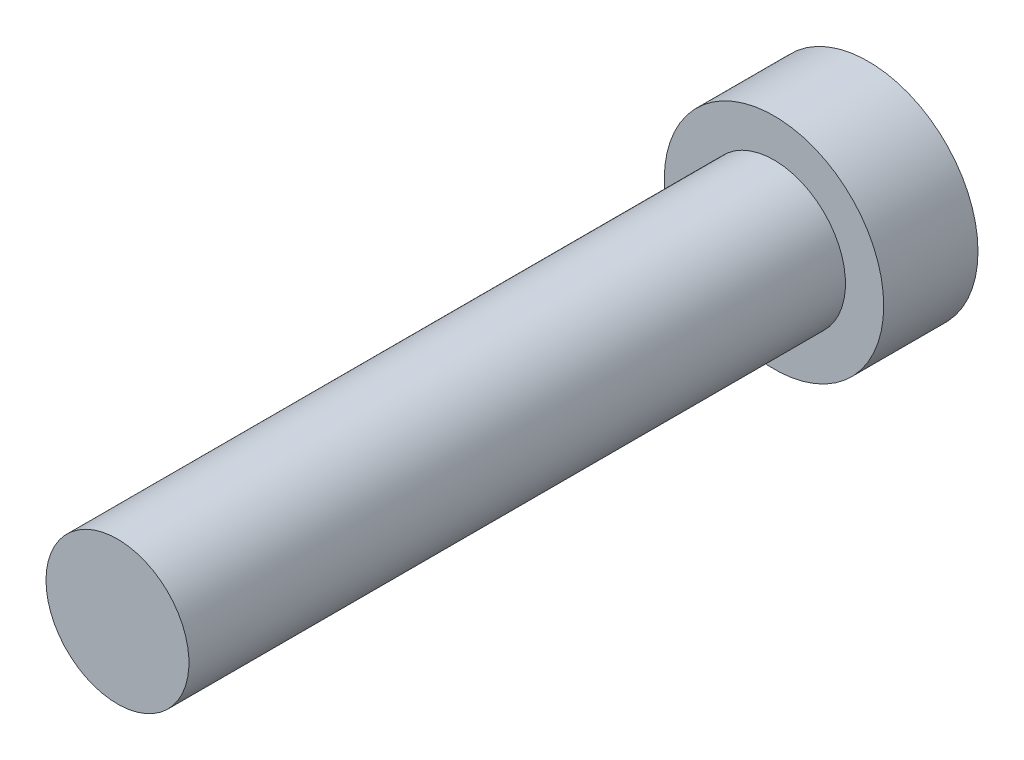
ISO-10303-21;
HEADER;
FILE_DESCRIPTION(('STEP AP214'),'2;1');
FILE_NAME('part.step','',(''),(''),'','','');
FILE_SCHEMA(('AUTOMOTIVE_DESIGN { 1 0 10303 214 1 1 1 1 }'));
ENDSEC;
DATA;
#1=APPLICATION_CONTEXT('core data for automotive mechanical design processes');
#2=APPLICATION_PROTOCOL_DEFINITION('international standard','automotive_design',2000,#1);
#3=PRODUCT_CONTEXT('',#1,'mechanical');
#4=PRODUCT('Part','Part','',(#3));
#5=PRODUCT_RELATED_PRODUCT_CATEGORY('part','',(#4));
#6=PRODUCT_DEFINITION_FORMATION('','',#4);
#7=PRODUCT_DEFINITION_CONTEXT('part definition',#1,'design');
#8=PRODUCT_DEFINITION('design','',#6,#7);
#9=PRODUCT_DEFINITION_SHAPE('','',#8);
#10=(LENGTH_UNIT() NAMED_UNIT(*) SI_UNIT(.MILLI.,.METRE.));
#11=(NAMED_UNIT(*) PLANE_ANGLE_UNIT() SI_UNIT($,.RADIAN.));
#12=(NAMED_UNIT(*) SI_UNIT($,.STERADIAN.) SOLID_ANGLE_UNIT());
#13=UNCERTAINTY_MEASURE_WITH_UNIT(LENGTH_MEASURE(1.E-05),#10,'distance_accuracy_value','');
#14=(GEOMETRIC_REPRESENTATION_CONTEXT(3) GLOBAL_UNCERTAINTY_ASSIGNED_CONTEXT((#13)) GLOBAL_UNIT_ASSIGNED_CONTEXT((#10,
#11,#12)) REPRESENTATION_CONTEXT('',''));
#15=CARTESIAN_POINT('',(0.,0.,0.));
#16=DIRECTION('',(0.,0.,1.));
#17=DIRECTION('',(1.,0.,0.));
#18=AXIS2_PLACEMENT_3D('',#15,#16,#17);
#19=CARTESIAN_POINT('',(0.,0.,-16.5467541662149));
#20=DIRECTION('',(0.,0.,-1.));
#21=DIRECTION('',(-1.,0.,0.));
#22=AXIS2_PLACEMENT_3D('',#19,#20,#21);
#23=CYLINDRICAL_SURFACE('',#22,5.55625);
#24=CARTESIAN_POINT('',(0.,0.,-4.7752));
#25=DIRECTION('',(0.,0.,-1.));
#26=DIRECTION('',(-1.,0.,0.));
#27=AXIS2_PLACEMENT_3D('',#24,#25,#26);
#28=CIRCLE('',#27,5.55625);
#29=CARTESIAN_POINT('',(-5.55625,0.,-4.7752));
#30=VERTEX_POINT('',#29);
#31=EDGE_CURVE('E58',#30,#30,#28,.T.);
#32=ORIENTED_EDGE('',*,*,#31,.F.);
#33=EDGE_LOOP('',(#32));
#34=FACE_BOUND('',#33,.T.);
#35=CARTESIAN_POINT('',(0.,0.,0.));
#36=DIRECTION('',(0.,0.,-1.));
#37=DIRECTION('',(-1.,0.,0.));
#38=AXIS2_PLACEMENT_3D('',#35,#36,#37);
#39=CIRCLE('',#38,5.55625);
#40=CARTESIAN_POINT('',(-5.55625,0.,0.));
#41=VERTEX_POINT('',#40);
#42=EDGE_CURVE('E10',#41,#41,#39,.T.);
#43=ORIENTED_EDGE('',*,*,#42,.T.);
#44=EDGE_LOOP('',(#43));
#45=FACE_BOUND('',#44,.T.);
#46=ADVANCED_FACE('F39',(#34,#45),#23,.T.);
#47=CARTESIAN_POINT('',(-3.6195,0.,0.));
#48=DIRECTION('',(0.,0.,-1.));
#49=DIRECTION('',(-1.,0.,0.));
#50=AXIS2_PLACEMENT_3D('',#47,#48,#49);
#51=PLANE('',#50);
#52=ORIENTED_EDGE('',*,*,#42,.F.);
#53=EDGE_LOOP('',(#52));
#54=FACE_BOUND('',#53,.T.);
#55=CARTESIAN_POINT('',(0.,0.,0.));
#56=DIRECTION('',(0.,0.,-1.));
#57=DIRECTION('',(-1.,0.,0.));
#58=AXIS2_PLACEMENT_3D('',#55,#56,#57);
#59=CIRCLE('',#58,3.6195);
#60=CARTESIAN_POINT('',(-3.6195,0.,0.));
#61=VERTEX_POINT('',#60);
#62=EDGE_CURVE('E46',#61,#61,#59,.T.);
#63=ORIENTED_EDGE('',*,*,#62,.T.);
#64=EDGE_LOOP('',(#63));
#65=FACE_BOUND('',#64,.T.);
#66=ADVANCED_FACE('F69',(#54,#65),#51,.F.);
#67=CARTESIAN_POINT('',(0.,0.,-16.5467541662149));
#68=DIRECTION('',(0.,0.,-1.));
#69=DIRECTION('',(-1.,0.,0.));
#70=AXIS2_PLACEMENT_3D('',#67,#68,#69);
#71=CYLINDRICAL_SURFACE('',#70,3.6195);
#72=ORIENTED_EDGE('',*,*,#62,.F.);
#73=EDGE_LOOP('',(#72));
#74=FACE_BOUND('',#73,.T.);
#75=CARTESIAN_POINT('',(0.,0.,33.24987));
#76=DIRECTION('',(0.,0.,-1.));
#77=DIRECTION('',(-1.,0.,0.));
#78=AXIS2_PLACEMENT_3D('',#75,#76,#77);
#79=CIRCLE('',#78,3.6195);
#80=CARTESIAN_POINT('',(-3.6195,0.,33.24987));
#81=VERTEX_POINT('',#80);
#82=EDGE_CURVE('E52',#81,#81,#79,.T.);
#83=ORIENTED_EDGE('',*,*,#82,.T.);
#84=EDGE_LOOP('',(#83));
#85=FACE_BOUND('',#84,.T.);
#86=ADVANCED_FACE('F73',(#74,#85),#71,.T.);
#87=CARTESIAN_POINT('',(0.,0.,33.24987));
#88=DIRECTION('',(0.,0.,-1.));
#89=DIRECTION('',(-1.,0.,0.));
#90=AXIS2_PLACEMENT_3D('',#87,#88,#89);
#91=PLANE('',#90);
#92=ORIENTED_EDGE('',*,*,#82,.F.);
#93=EDGE_LOOP('',(#92));
#94=FACE_BOUND('',#93,.T.);
#95=ADVANCED_FACE('F78',(#94),#91,.F.);
#96=CARTESIAN_POINT('',(0.,0.,-4.7752));
#97=DIRECTION('',(0.,0.,1.));
#98=DIRECTION('',(1.,0.,0.));
#99=AXIS2_PLACEMENT_3D('',#96,#97,#98);
#100=PLANE('',#99);
#101=ORIENTED_EDGE('',*,*,#31,.T.);
#102=EDGE_LOOP('',(#101));
#103=FACE_BOUND('',#102,.T.);
#104=ADVANCED_FACE('F66',(#103),#100,.F.);
#105=CLOSED_SHELL('',(#46,#66,#86,#95,#104));
#106=MANIFOLD_SOLID_BREP('B2',#105);
#107=ADVANCED_BREP_SHAPE_REPRESENTATION('',(#18,#106),#14);
#108=SHAPE_DEFINITION_REPRESENTATION(#9,#107);
ENDSEC;
END-ISO-10303-21;
